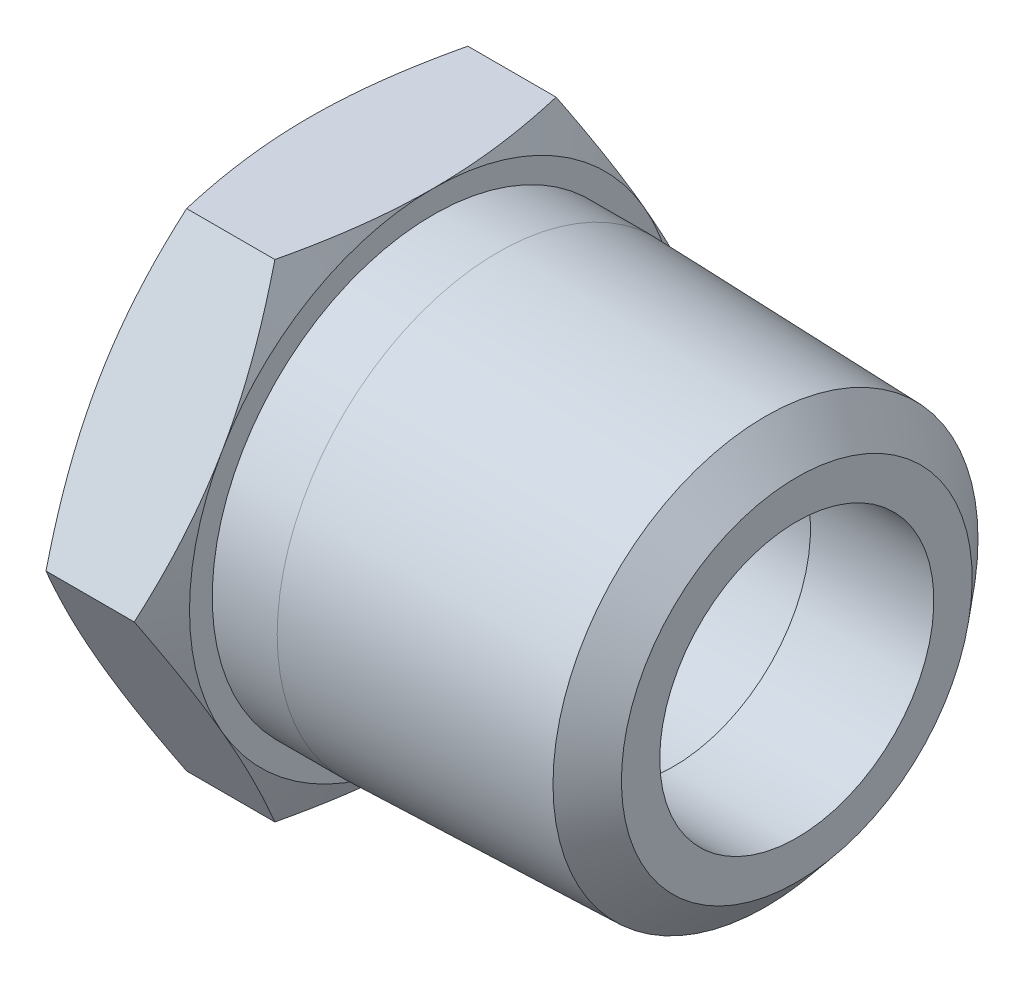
ISO-10303-21;
HEADER;
FILE_DESCRIPTION(('STEP AP214'),'2;1');
FILE_NAME('part.step','',(''),(''),'','','');
FILE_SCHEMA(('AUTOMOTIVE_DESIGN { 1 0 10303 214 1 1 1 1 }'));
ENDSEC;
DATA;
#1=APPLICATION_CONTEXT('core data for automotive mechanical design processes');
#2=APPLICATION_PROTOCOL_DEFINITION('international standard','automotive_design',2000,#1);
#3=PRODUCT_CONTEXT('',#1,'mechanical');
#4=PRODUCT('Part','Part','',(#3));
#5=PRODUCT_RELATED_PRODUCT_CATEGORY('part','',(#4));
#6=PRODUCT_DEFINITION_FORMATION('','',#4);
#7=PRODUCT_DEFINITION_CONTEXT('part definition',#1,'design');
#8=PRODUCT_DEFINITION('design','',#6,#7);
#9=PRODUCT_DEFINITION_SHAPE('','',#8);
#10=(LENGTH_UNIT() NAMED_UNIT(*) SI_UNIT(.MILLI.,.METRE.));
#11=(NAMED_UNIT(*) PLANE_ANGLE_UNIT() SI_UNIT($,.RADIAN.));
#12=(NAMED_UNIT(*) SI_UNIT($,.STERADIAN.) SOLID_ANGLE_UNIT());
#13=UNCERTAINTY_MEASURE_WITH_UNIT(LENGTH_MEASURE(1.E-05),#10,'distance_accuracy_value','');
#14=(GEOMETRIC_REPRESENTATION_CONTEXT(3) GLOBAL_UNCERTAINTY_ASSIGNED_CONTEXT((#13)) GLOBAL_UNIT_ASSIGNED_CONTEXT((#10,
#11,#12)) REPRESENTATION_CONTEXT('',''));
#15=CARTESIAN_POINT('',(0.,0.,0.));
#16=DIRECTION('',(0.,0.,1.));
#17=DIRECTION('',(1.,0.,0.));
#18=AXIS2_PLACEMENT_3D('',#15,#16,#17);
#19=CARTESIAN_POINT('',(-6.25277607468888E-10,0.,0.));
#20=DIRECTION('',(-1.,0.,0.));
#21=DIRECTION('',(0.,0.,1.));
#22=AXIS2_PLACEMENT_3D('',#19,#20,#21);
#23=CONICAL_SURFACE('',#22,7.11199999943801,0.816517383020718);
#24=CARTESIAN_POINT('',(1.17665145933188,0.,0.));
#25=DIRECTION('',(-1.,0.,0.));
#26=DIRECTION('',(0.,1.,0.));
#27=AXIS2_PLACEMENT_3D('',#24,#25,#26);
#28=CIRCLE('',#27,5.85973824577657);
#29=CARTESIAN_POINT('',(1.17665145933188,5.85973824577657,0.));
#30=VERTEX_POINT('',#29);
#31=EDGE_CURVE('E380',#30,#30,#28,.F.);
#32=ORIENTED_EDGE('',*,*,#31,.T.);
#33=EDGE_LOOP('',(#32));
#34=FACE_BOUND('',#33,.T.);
#35=CARTESIAN_POINT('',(-6.25277607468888E-10,0.,0.));
#36=DIRECTION('',(-1.,0.,0.));
#37=DIRECTION('',(0.,0.,1.));
#38=AXIS2_PLACEMENT_3D('',#35,#36,#37);
#39=CIRCLE('',#38,7.11199999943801);
#40=CARTESIAN_POINT('',(-6.25277607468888E-10,0.,7.11199999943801));
#41=VERTEX_POINT('',#40);
#42=EDGE_CURVE('E20',#41,#41,#39,.T.);
#43=ORIENTED_EDGE('',*,*,#42,.T.);
#44=EDGE_LOOP('',(#43));
#45=FACE_BOUND('',#44,.T.);
#46=ADVANCED_FACE('F16',(#34,#45),#23,.F.);
#47=CARTESIAN_POINT('',(1.17665145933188,0.,0.));
#48=DIRECTION('',(-1.,0.,0.));
#49=DIRECTION('',(0.,0.,1.));
#50=AXIS2_PLACEMENT_3D('',#47,#48,#49);
#51=CONICAL_SURFACE('',#50,5.85973824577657,0.0311192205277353);
#52=CARTESIAN_POINT('',(9.906,0.,0.));
#53=DIRECTION('',(1.,0.,0.));
#54=DIRECTION('',(0.,0.,-1.));
#55=AXIS2_PLACEMENT_3D('',#52,#53,#54);
#56=CIRCLE('',#55,5.588);
#57=CARTESIAN_POINT('',(9.906,0.,-5.588));
#58=VERTEX_POINT('',#57);
#59=EDGE_CURVE('E114',#58,#58,#56,.T.);
#60=ORIENTED_EDGE('',*,*,#59,.T.);
#61=EDGE_LOOP('',(#60));
#62=FACE_BOUND('',#61,.T.);
#63=ORIENTED_EDGE('',*,*,#31,.F.);
#64=EDGE_LOOP('',(#63));
#65=FACE_BOUND('',#64,.T.);
#66=ADVANCED_FACE('F616',(#62,#65),#51,.F.);
#67=CARTESIAN_POINT('',(0.,0.,0.));
#68=DIRECTION('',(1.,0.,0.));
#69=DIRECTION('',(0.,0.,-1.));
#70=AXIS2_PLACEMENT_3D('',#67,#68,#69);
#71=PLANE('',#70);
#72=ORIENTED_EDGE('',*,*,#42,.F.);
#73=EDGE_LOOP('',(#72));
#74=FACE_BOUND('',#73,.T.);
#75=CARTESIAN_POINT('',(-6.1736963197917E-09,0.,0.));
#76=DIRECTION('',(1.,0.,0.));
#77=DIRECTION('',(0.,0.,-1.));
#78=AXIS2_PLACEMENT_3D('',#75,#76,#77);
#79=CIRCLE('',#78,9.52500000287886);
#80=CARTESIAN_POINT('',(-6.84491351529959E-09,-4.76250000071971,-8.24889197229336));
#81=VERTEX_POINT('',#80);
#82=CARTESIAN_POINT('',(-6.84491939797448E-09,4.76250000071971,-8.24889197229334));
#83=VERTEX_POINT('',#82);
#84=EDGE_CURVE('E106',#81,#83,#79,.T.);
#85=ORIENTED_EDGE('',*,*,#84,.F.);
#86=CARTESIAN_POINT('',(-6.17370076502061E-09,0.,0.));
#87=DIRECTION('',(1.,0.,0.));
#88=DIRECTION('',(0.,0.,-1.));
#89=AXIS2_PLACEMENT_3D('',#86,#87,#88);
#90=CIRCLE('',#89,9.52500000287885);
#91=CARTESIAN_POINT('',(-6.84491439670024E-09,-9.52500000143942,0.));
#92=VERTEX_POINT('',#91);
#93=EDGE_CURVE('E125',#92,#81,#90,.T.);
#94=ORIENTED_EDGE('',*,*,#93,.F.);
#95=CARTESIAN_POINT('',(-6.17370466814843E-09,0.,0.));
#96=DIRECTION('',(1.,0.,0.));
#97=DIRECTION('',(0.,0.,-1.));
#98=AXIS2_PLACEMENT_3D('',#95,#96,#97);
#99=CIRCLE('',#98,9.52500000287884);
#100=CARTESIAN_POINT('',(-6.84491424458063E-09,-4.76250000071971,8.24889197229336));
#101=VERTEX_POINT('',#100);
#102=EDGE_CURVE('E445',#101,#92,#99,.T.);
#103=ORIENTED_EDGE('',*,*,#102,.F.);
#104=CARTESIAN_POINT('',(-6.1736963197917E-09,0.,0.));
#105=DIRECTION('',(1.,0.,0.));
#106=DIRECTION('',(0.,0.,-1.));
#107=AXIS2_PLACEMENT_3D('',#104,#105,#106);
#108=CIRCLE('',#107,9.52500000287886);
#109=CARTESIAN_POINT('',(-6.84491379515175E-09,4.76250000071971,8.24889197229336));
#110=VERTEX_POINT('',#109);
#111=EDGE_CURVE('E447',#110,#101,#108,.T.);
#112=ORIENTED_EDGE('',*,*,#111,.F.);
#113=CARTESIAN_POINT('',(-6.17370076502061E-09,0.,0.));
#114=DIRECTION('',(1.,0.,0.));
#115=DIRECTION('',(0.,0.,-1.));
#116=AXIS2_PLACEMENT_3D('',#113,#114,#115);
#117=CIRCLE('',#116,9.52500000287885);
#118=CARTESIAN_POINT('',(-6.84491440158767E-09,9.52500000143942,0.));
#119=VERTEX_POINT('',#118);
#120=EDGE_CURVE('E109',#119,#110,#117,.T.);
#121=ORIENTED_EDGE('',*,*,#120,.F.);
#122=CARTESIAN_POINT('',(-6.1737051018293E-09,0.,0.));
#123=DIRECTION('',(1.,0.,0.));
#124=DIRECTION('',(0.,0.,-1.));
#125=AXIS2_PLACEMENT_3D('',#122,#123,#124);
#126=CIRCLE('',#125,9.52500000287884);
#127=EDGE_CURVE('E103',#83,#119,#126,.T.);
#128=ORIENTED_EDGE('',*,*,#127,.F.);
#129=EDGE_LOOP('',(#85,#94,#103,#112,#121,#128));
#130=FACE_BOUND('',#129,.T.);
#131=ADVANCED_FACE('F105',(#74,#130),#71,.F.);
#132=CARTESIAN_POINT('',(9.906,0.,0.));
#133=DIRECTION('',(1.,0.,0.));
#134=DIRECTION('',(0.,0.,-1.));
#135=AXIS2_PLACEMENT_3D('',#132,#133,#134);
#136=CYLINDRICAL_SURFACE('',#135,5.588);
#137=ORIENTED_EDGE('',*,*,#59,.F.);
#138=EDGE_LOOP('',(#137));
#139=FACE_BOUND('',#138,.T.);
#140=CARTESIAN_POINT('',(14.224,0.,0.));
#141=DIRECTION('',(1.,0.,0.));
#142=DIRECTION('',(0.,0.,-1.));
#143=AXIS2_PLACEMENT_3D('',#140,#141,#142);
#144=CIRCLE('',#143,5.588);
#145=CARTESIAN_POINT('',(14.224,0.,-5.588));
#146=VERTEX_POINT('',#145);
#147=EDGE_CURVE('E124',#146,#146,#144,.T.);
#148=ORIENTED_EDGE('',*,*,#147,.T.);
#149=EDGE_LOOP('',(#148));
#150=FACE_BOUND('',#149,.T.);
#151=ADVANCED_FACE('F604',(#139,#150),#136,.F.);
#152=CARTESIAN_POINT('',(0.691237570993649,0.,0.));
#153=DIRECTION('',(1.,0.,0.));
#154=DIRECTION('',(0.,0.,-1.));
#155=AXIS2_PLACEMENT_3D('',#152,#153,#154);
#156=CONICAL_SURFACE('',#155,11.0073637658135,1.1344640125);
#157=ORIENTED_EDGE('',*,*,#127,.T.);
#158=CARTESIAN_POINT('',(0.687114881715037,9.52499999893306,-5.49926131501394));
#159=CARTESIAN_POINT('',(0.581879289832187,9.52499999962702,-5.04806884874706));
#160=CARTESIAN_POINT('',(0.485840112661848,9.52499999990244,-4.59444540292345));
#161=CARTESIAN_POINT('',(0.316783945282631,9.52500000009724,-3.68454136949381));
#162=CARTESIAN_POINT('',(0.243690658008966,9.52500000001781,-3.22827483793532));
#163=CARTESIAN_POINT('',(0.154189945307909,9.52499999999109,-2.54105947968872));
#164=CARTESIAN_POINT('',(0.127705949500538,9.5249999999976,-2.3114203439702));
#165=CARTESIAN_POINT('',(0.0819146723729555,9.5250000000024,-1.85142525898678));
#166=CARTESIAN_POINT('',(0.0626072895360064,9.52500000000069,-1.62106931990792));
#167=CARTESIAN_POINT('',(0.031492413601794,9.52499999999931,-1.15907579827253));
#168=CARTESIAN_POINT('',(0.0197101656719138,9.52499999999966,-0.927436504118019));
#169=CARTESIAN_POINT('',(0.00394974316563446,9.52500000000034,-0.463867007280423));
#170=CARTESIAN_POINT('',(-2.75341416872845E-05,9.52500000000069,-0.231936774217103));
#171=CARTESIAN_POINT('',(-7.5161284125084E-09,9.525,-1.4605006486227E-10));
#172=B_SPLINE_CURVE_WITH_KNOTS('',3,(#158,#159,#160,#161,#162,#163,#164,#165,#166,#167,#168,
#169,#170,#171),.UNSPECIFIED.,.F.,.F.,(4,2,2,2,2,2,4),(0.,1.39025784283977,2.77584275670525,
3.46922419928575,4.16259583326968,4.858281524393,5.55404718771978),.UNSPECIFIED.);
#173=CARTESIAN_POINT('',(0.687114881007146,9.52500000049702,-5.49926131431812));
#174=VERTEX_POINT('',#173);
#175=EDGE_CURVE('E130',#174,#119,#172,.T.);
#176=ORIENTED_EDGE('',*,*,#175,.F.);
#177=CARTESIAN_POINT('',(-6.88972180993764E-09,4.76249999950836,-8.24889197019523));
#178=CARTESIAN_POINT('',(-2.75339178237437E-05,4.9633631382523,-8.1329235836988));
#179=CARTESIAN_POINT('',(0.00394974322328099,5.16422061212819,-8.01695846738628));
#180=CARTESIAN_POINT('',(0.0197101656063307,5.56568357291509,-7.78517371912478));
#181=CARTESIAN_POINT('',(0.0314924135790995,5.76628908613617,-7.66935407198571));
#182=CARTESIAN_POINT('',(0.06260728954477,6.16638721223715,-7.43835731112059));
#183=CARTESIAN_POINT('',(0.08191467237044,6.36588130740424,-7.32317934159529));
#184=CARTESIAN_POINT('',(0.127705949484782,6.76424873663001,-7.09318179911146));
#185=CARTESIAN_POINT('',(0.154189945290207,6.96312206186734,-6.97836223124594));
#186=CARTESIAN_POINT('',(0.243690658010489,7.55826801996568,-6.634754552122));
#187=CARTESIAN_POINT('',(0.316783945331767,7.95340642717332,-6.40662128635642));
#188=CARTESIAN_POINT('',(0.48584011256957,8.74140643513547,-5.95166926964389));
#189=CARTESIAN_POINT('',(0.581879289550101,9.13425586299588,-5.72485754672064));
#190=CARTESIAN_POINT('',(0.687114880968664,9.52500000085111,-5.49926131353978));
#191=B_SPLINE_CURVE_WITH_KNOTS('',3,(#177,#178,#179,#180,#181,#182,#183,#184,#185,#186,#187,
#188,#189,#190),.UNSPECIFIED.,.F.,.F.,(4,2,2,2,2,2,4),(0.,0.695765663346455,1.39145135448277,
2.08482298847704,2.77820443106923,4.16378934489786,5.55404718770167),.UNSPECIFIED.);
#192=EDGE_CURVE('E127',#83,#174,#191,.T.);
#193=ORIENTED_EDGE('',*,*,#192,.F.);
#194=EDGE_LOOP('',(#157,#176,#193));
#195=FACE_BOUND('',#194,.T.);
#196=ADVANCED_FACE('F128',(#195),#156,.T.);
#197=CARTESIAN_POINT('',(0.691237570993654,0.,0.));
#198=DIRECTION('',(1.,0.,0.));
#199=DIRECTION('',(0.,0.,-1.));
#200=AXIS2_PLACEMENT_3D('',#197,#198,#199);
#201=CONICAL_SURFACE('',#200,11.0073637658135,1.1344640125);
#202=CARTESIAN_POINT('',(-6.88971572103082E-09,9.52499999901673,0.));
#203=CARTESIAN_POINT('',(-2.75339178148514E-05,9.5249999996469,0.231936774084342));
#204=CARTESIAN_POINT('',(0.00394974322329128,9.52499999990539,0.463867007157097));
#205=CARTESIAN_POINT('',(0.0197101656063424,9.5250000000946,0.927436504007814));
#206=CARTESIAN_POINT('',(0.0314924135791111,9.52500000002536,1.15907579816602));
#207=CARTESIAN_POINT('',(0.0626072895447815,9.52499999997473,1.62106931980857));
#208=CARTESIAN_POINT('',(0.0819146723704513,9.52499999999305,1.85142525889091));
#209=CARTESIAN_POINT('',(0.127705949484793,9.52500000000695,2.31142034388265));
#210=CARTESIAN_POINT('',(0.154189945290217,9.52500000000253,2.54105947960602));
#211=CARTESIAN_POINT('',(0.243690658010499,9.52499999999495,3.22827483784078));
#212=CARTESIAN_POINT('',(0.316783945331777,9.52499999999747,3.6845413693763));
#213=CARTESIAN_POINT('',(0.485840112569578,9.52500000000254,4.59444540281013));
#214=CARTESIAN_POINT('',(0.581879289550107,9.52500000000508,5.04806884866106));
#215=CARTESIAN_POINT('',(0.687114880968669,9.525,5.49926131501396));
#216=B_SPLINE_CURVE_WITH_KNOTS('',3,(#202,#203,#204,#205,#206,#207,#208,#209,#210,#211,#212,
#213,#214,#215),.UNSPECIFIED.,.F.,.F.,(4,2,2,2,2,2,4),(0.,0.695765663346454,1.39145135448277,
2.08482298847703,2.77820443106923,4.16378934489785,5.55404718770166),.UNSPECIFIED.);
#217=CARTESIAN_POINT('',(0.687114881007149,9.52500000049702,5.49926131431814));
#218=VERTEX_POINT('',#217);
#219=EDGE_CURVE('E299',#119,#218,#216,.T.);
#220=ORIENTED_EDGE('',*,*,#219,.F.);
#221=ORIENTED_EDGE('',*,*,#120,.T.);
#222=CARTESIAN_POINT('',(0.687114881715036,9.52500000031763,5.4992613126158));
#223=CARTESIAN_POINT('',(0.58187928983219,9.13425586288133,5.72485754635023));
#224=CARTESIAN_POINT('',(0.485840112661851,8.74140643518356,5.95166926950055));
#225=CARTESIAN_POINT('',(0.316783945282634,7.95340642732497,6.40662128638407));
#226=CARTESIAN_POINT('',(0.243690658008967,7.55826802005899,6.63475455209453));
#227=CARTESIAN_POINT('',(0.15418994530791,6.96312206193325,6.97836223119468));
#228=CARTESIAN_POINT('',(0.127705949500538,6.76424873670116,7.09318179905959));
#229=CARTESIAN_POINT('',(0.0819146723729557,6.36588130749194,7.32317934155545));
#230=CARTESIAN_POINT('',(0.0626072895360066,6.16638721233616,7.4383573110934));
#231=CARTESIAN_POINT('',(0.0314924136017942,5.76628908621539,7.6693540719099));
#232=CARTESIAN_POINT('',(0.0197101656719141,5.56568357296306,7.78517371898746));
#233=CARTESIAN_POINT('',(0.00394974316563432,5.16422061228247,8.01695846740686));
#234=CARTESIAN_POINT('',(-2.7534141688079E-05,4.96336313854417,8.13292358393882));
#235=CARTESIAN_POINT('',(-7.51613087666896E-09,4.76250000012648,8.24889197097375));
#236=B_SPLINE_CURVE_WITH_KNOTS('',3,(#222,#223,#224,#225,#226,#227,#228,#229,#230,#231,#232,
#233,#234,#235),.UNSPECIFIED.,.F.,.F.,(4,2,2,2,2,2,4),(0.,1.39025784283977,2.77584275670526,
3.46922419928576,4.1625958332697,4.85828152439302,5.5540471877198),.UNSPECIFIED.);
#237=EDGE_CURVE('E292',#218,#110,#236,.T.);
#238=ORIENTED_EDGE('',*,*,#237,.F.);
#239=EDGE_LOOP('',(#220,#221,#238));
#240=FACE_BOUND('',#239,.T.);
#241=ADVANCED_FACE('F282',(#240),#201,.T.);
#242=CARTESIAN_POINT('',(0.69123757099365,0.,0.));
#243=DIRECTION('',(1.,0.,0.));
#244=DIRECTION('',(0.,0.,-1.));
#245=AXIS2_PLACEMENT_3D('',#242,#243,#244);
#246=CONICAL_SURFACE('',#245,11.0073637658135,1.1344640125);
#247=CARTESIAN_POINT('',(-6.88972179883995E-09,4.76249999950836,8.24889197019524));
#248=CARTESIAN_POINT('',(-2.75339178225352E-05,4.56163686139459,8.36486035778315));
#249=CARTESIAN_POINT('',(0.00394974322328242,4.36077938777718,8.48082547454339));
#250=CARTESIAN_POINT('',(0.0197101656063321,3.9593164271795,8.7126102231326));
#251=CARTESIAN_POINT('',(0.0314924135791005,3.75871091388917,8.82842987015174));
#252=CARTESIAN_POINT('',(0.0626072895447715,3.35861278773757,9.05942663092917));
#253=CARTESIAN_POINT('',(0.0819146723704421,3.1591186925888,9.17460460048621));
#254=CARTESIAN_POINT('',(0.127705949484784,2.76075126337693,9.40460214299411));
#255=CARTESIAN_POINT('',(0.154189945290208,2.56187793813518,9.51942171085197));
#256=CARTESIAN_POINT('',(0.24369065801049,1.96673198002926,9.86302938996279));
#257=CARTESIAN_POINT('',(0.316783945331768,1.57159357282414,10.0911626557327));
#258=CARTESIAN_POINT('',(0.485840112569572,0.783593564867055,10.546114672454));
#259=CARTESIAN_POINT('',(0.581879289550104,0.390744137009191,10.7729263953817));
#260=CARTESIAN_POINT('',(0.687114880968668,-8.51118452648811E-10,10.9985226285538));
#261=B_SPLINE_CURVE_WITH_KNOTS('',3,(#247,#248,#249,#250,#251,#252,#253,#254,#255,#256,#257,
#258,#259,#260),.UNSPECIFIED.,.F.,.F.,(4,2,2,2,2,2,4),(0.,0.695765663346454,1.39145135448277,
2.08482298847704,2.77820443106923,4.16378934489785,5.55404718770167),.UNSPECIFIED.);
#262=CARTESIAN_POINT('',(0.687114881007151,0.,10.9985226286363));
#263=VERTEX_POINT('',#262);
#264=EDGE_CURVE('E286',#110,#263,#261,.T.);
#265=ORIENTED_EDGE('',*,*,#264,.F.);
#266=ORIENTED_EDGE('',*,*,#111,.T.);
#267=CARTESIAN_POINT('',(0.687114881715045,1.38456617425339E-09,10.9985226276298));
#268=CARTESIAN_POINT('',(0.581879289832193,-0.390744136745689,10.7729263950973));
#269=CARTESIAN_POINT('',(0.485840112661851,-0.783593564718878,10.546114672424));
#270=CARTESIAN_POINT('',(0.316783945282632,-1.57159357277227,10.0911626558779));
#271=CARTESIAN_POINT('',(0.243690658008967,-1.96673197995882,9.86302939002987));
#272=CARTESIAN_POINT('',(0.154189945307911,-2.56187793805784,9.51942171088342));
#273=CARTESIAN_POINT('',(0.12770594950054,-2.76075126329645,9.4046021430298));
#274=CARTESIAN_POINT('',(0.0819146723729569,-3.15911869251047,9.17460460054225));
#275=CARTESIAN_POINT('',(0.0626072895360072,-3.35861278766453,9.05942663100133));
#276=CARTESIAN_POINT('',(0.0314924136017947,-3.75871091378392,8.82842987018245));
#277=CARTESIAN_POINT('',(0.0197101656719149,-3.9593164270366,8.71261022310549));
#278=CARTESIAN_POINT('',(0.00394974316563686,-4.36077938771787,8.48082547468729));
#279=CARTESIAN_POINT('',(-2.75341416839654E-05,-4.56163686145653,8.36486035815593));
#280=CARTESIAN_POINT('',(-7.51612411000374E-09,-4.76249999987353,8.24889197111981));
#281=B_SPLINE_CURVE_WITH_KNOTS('',3,(#267,#268,#269,#270,#271,#272,#273,#274,#275,#276,#277,
#278,#279,#280),.UNSPECIFIED.,.F.,.F.,(4,2,2,2,2,2,4),(0.,1.39025784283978,2.77584275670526,
3.46922419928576,4.1625958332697,4.85828152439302,5.5540471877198),.UNSPECIFIED.);
#282=EDGE_CURVE('E263',#263,#101,#281,.T.);
#283=ORIENTED_EDGE('',*,*,#282,.F.);
#284=EDGE_LOOP('',(#265,#266,#283));
#285=FACE_BOUND('',#284,.T.);
#286=ADVANCED_FACE('F276',(#285),#246,.T.);
#287=CARTESIAN_POINT('',(0.691237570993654,0.,0.));
#288=DIRECTION('',(1.,0.,0.));
#289=DIRECTION('',(0.,0.,-1.));
#290=AXIS2_PLACEMENT_3D('',#287,#288,#289);
#291=CONICAL_SURFACE('',#290,11.0073637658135,1.1344640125);
#292=CARTESIAN_POINT('',(-6.88970853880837E-09,-4.76249999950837,8.24889197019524));
#293=CARTESIAN_POINT('',(-2.75339178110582E-05,-4.96336313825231,8.13292358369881));
#294=CARTESIAN_POINT('',(0.00394974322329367,-5.1642206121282,8.0169584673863));
#295=CARTESIAN_POINT('',(0.0197101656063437,-5.5656835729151,7.7851737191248));
#296=CARTESIAN_POINT('',(0.0314924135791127,-5.76628908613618,7.66935407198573));
#297=CARTESIAN_POINT('',(0.0626072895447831,-6.16638721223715,7.43835731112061));
#298=CARTESIAN_POINT('',(0.0819146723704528,-6.36588130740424,7.3231793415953));
#299=CARTESIAN_POINT('',(0.127705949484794,-6.76424873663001,7.09318179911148));
#300=CARTESIAN_POINT('',(0.154189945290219,-6.96312206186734,6.97836223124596));
#301=CARTESIAN_POINT('',(0.2436906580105,-7.55826801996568,6.63475455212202));
#302=CARTESIAN_POINT('',(0.316783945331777,-7.95340642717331,6.40662128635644));
#303=CARTESIAN_POINT('',(0.485840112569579,-8.74140643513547,5.95166926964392));
#304=CARTESIAN_POINT('',(0.581879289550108,-9.13425586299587,5.72485754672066));
#305=CARTESIAN_POINT('',(0.687114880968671,-9.5250000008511,5.49926131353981));
#306=B_SPLINE_CURVE_WITH_KNOTS('',3,(#292,#293,#294,#295,#296,#297,#298,#299,#300,#301,#302,
#303,#304,#305),.UNSPECIFIED.,.F.,.F.,(4,2,2,2,2,2,4),(0.,0.695765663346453,1.39145135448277,
2.08482298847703,2.77820443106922,4.16378934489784,5.55404718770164),.UNSPECIFIED.);
#307=CARTESIAN_POINT('',(0.687114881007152,-9.52500000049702,5.49926131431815));
#308=VERTEX_POINT('',#307);
#309=EDGE_CURVE('E257',#101,#308,#306,.T.);
#310=ORIENTED_EDGE('',*,*,#309,.F.);
#311=ORIENTED_EDGE('',*,*,#102,.T.);
#312=CARTESIAN_POINT('',(0.687114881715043,-9.52499999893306,5.49926131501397));
#313=CARTESIAN_POINT('',(0.581879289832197,-9.52499999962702,5.04806884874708));
#314=CARTESIAN_POINT('',(0.485840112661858,-9.52499999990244,4.59444540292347));
#315=CARTESIAN_POINT('',(0.31678394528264,-9.52500000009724,3.68454136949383));
#316=CARTESIAN_POINT('',(0.243690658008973,-9.52500000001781,3.22827483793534));
#317=CARTESIAN_POINT('',(0.154189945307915,-9.52499999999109,2.54105947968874));
#318=CARTESIAN_POINT('',(0.127705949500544,-9.5249999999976,2.31142034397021));
#319=CARTESIAN_POINT('',(0.0819146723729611,-9.5250000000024,1.85142525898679));
#320=CARTESIAN_POINT('',(0.0626072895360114,-9.52500000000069,1.62106931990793));
#321=CARTESIAN_POINT('',(0.0314924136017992,-9.52499999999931,1.15907579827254));
#322=CARTESIAN_POINT('',(0.0197101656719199,-9.52499999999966,0.927436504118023));
#323=CARTESIAN_POINT('',(0.00394974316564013,-9.52500000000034,0.463867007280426));
#324=CARTESIAN_POINT('',(-2.75341416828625E-05,-9.52500000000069,0.231936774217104));
#325=CARTESIAN_POINT('',(-7.51612806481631E-09,-9.525,1.46051092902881E-10));
#326=B_SPLINE_CURVE_WITH_KNOTS('',3,(#312,#313,#314,#315,#316,#317,#318,#319,#320,#321,#322,
#323,#324,#325),.UNSPECIFIED.,.F.,.F.,(4,2,2,2,2,2,4),(0.,1.39025784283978,2.77584275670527,
3.46922419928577,4.16259583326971,4.85828152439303,5.55404718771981),.UNSPECIFIED.);
#327=EDGE_CURVE('E264',#308,#92,#326,.T.);
#328=ORIENTED_EDGE('',*,*,#327,.F.);
#329=EDGE_LOOP('',(#310,#311,#328));
#330=FACE_BOUND('',#329,.T.);
#331=ADVANCED_FACE('F273',(#330),#291,.T.);
#332=CARTESIAN_POINT('',(0.691237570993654,0.,0.));
#333=DIRECTION('',(1.,0.,0.));
#334=DIRECTION('',(0.,0.,-1.));
#335=AXIS2_PLACEMENT_3D('',#332,#333,#334);
#336=CONICAL_SURFACE('',#335,11.0073637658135,1.1344640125);
#337=ORIENTED_EDGE('',*,*,#93,.T.);
#338=CARTESIAN_POINT('',(0.687114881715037,-9.52500000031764,-5.4992613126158));
#339=CARTESIAN_POINT('',(0.581879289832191,-9.13425586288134,-5.72485754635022));
#340=CARTESIAN_POINT('',(0.485840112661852,-8.74140643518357,-5.95166926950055));
#341=CARTESIAN_POINT('',(0.316783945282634,-7.95340642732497,-6.40662128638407));
#342=CARTESIAN_POINT('',(0.243690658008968,-7.558268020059,-6.63475455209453));
#343=CARTESIAN_POINT('',(0.154189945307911,-6.96312206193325,-6.97836223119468));
#344=CARTESIAN_POINT('',(0.127705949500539,-6.76424873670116,-7.09318179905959));
#345=CARTESIAN_POINT('',(0.0819146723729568,-6.36588130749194,-7.32317934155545));
#346=CARTESIAN_POINT('',(0.0626072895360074,-6.16638721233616,-7.4383573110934));
#347=CARTESIAN_POINT('',(0.0314924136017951,-5.76628908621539,-7.66935407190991));
#348=CARTESIAN_POINT('',(0.0197101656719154,-5.56568357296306,-7.78517371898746));
#349=CARTESIAN_POINT('',(0.00394974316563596,-5.16422061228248,-8.01695846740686));
#350=CARTESIAN_POINT('',(-2.75341416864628E-05,-4.96336313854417,-8.13292358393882));
#351=CARTESIAN_POINT('',(-7.51613003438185E-09,-4.76250000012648,-8.24889197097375));
#352=B_SPLINE_CURVE_WITH_KNOTS('',3,(#338,#339,#340,#341,#342,#343,#344,#345,#346,#347,#348,
#349,#350,#351),.UNSPECIFIED.,.F.,.F.,(4,2,2,2,2,2,4),(0.,1.39025784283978,2.77584275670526,
3.46922419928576,4.1625958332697,4.85828152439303,5.55404718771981),.UNSPECIFIED.);
#353=CARTESIAN_POINT('',(0.687114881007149,-9.52500000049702,-5.49926131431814));
#354=VERTEX_POINT('',#353);
#355=EDGE_CURVE('E168',#354,#81,#352,.T.);
#356=ORIENTED_EDGE('',*,*,#355,.F.);
#357=CARTESIAN_POINT('',(-6.88971571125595E-09,-9.52499999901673,0.));
#358=CARTESIAN_POINT('',(-2.75339178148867E-05,-9.5249999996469,-0.231936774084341));
#359=CARTESIAN_POINT('',(0.00394974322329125,-9.52499999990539,-0.463867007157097));
#360=CARTESIAN_POINT('',(0.0197101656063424,-9.5250000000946,-0.927436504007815));
#361=CARTESIAN_POINT('',(0.0314924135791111,-9.52500000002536,-1.15907579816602));
#362=CARTESIAN_POINT('',(0.0626072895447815,-9.52499999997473,-1.62106931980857));
#363=CARTESIAN_POINT('',(0.0819146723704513,-9.52499999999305,-1.85142525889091));
#364=CARTESIAN_POINT('',(0.127705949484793,-9.52500000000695,-2.31142034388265));
#365=CARTESIAN_POINT('',(0.154189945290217,-9.52500000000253,-2.54105947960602));
#366=CARTESIAN_POINT('',(0.243690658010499,-9.52499999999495,-3.22827483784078));
#367=CARTESIAN_POINT('',(0.316783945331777,-9.52499999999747,-3.6845413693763));
#368=CARTESIAN_POINT('',(0.485840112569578,-9.52500000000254,-4.59444540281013));
#369=CARTESIAN_POINT('',(0.581879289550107,-9.52500000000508,-5.04806884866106));
#370=CARTESIAN_POINT('',(0.687114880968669,-9.525,-5.49926131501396));
#371=B_SPLINE_CURVE_WITH_KNOTS('',3,(#357,#358,#359,#360,#361,#362,#363,#364,#365,#366,#367,
#368,#369,#370),.UNSPECIFIED.,.F.,.F.,(4,2,2,2,2,2,4),(0.,0.695765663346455,1.39145135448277,
2.08482298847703,2.77820443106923,4.16378934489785,5.55404718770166),.UNSPECIFIED.);
#372=EDGE_CURVE('E370',#92,#354,#371,.T.);
#373=ORIENTED_EDGE('',*,*,#372,.F.);
#374=EDGE_LOOP('',(#337,#356,#373));
#375=FACE_BOUND('',#374,.T.);
#376=ADVANCED_FACE('F157',(#375),#336,.T.);
#377=CARTESIAN_POINT('',(0.69123757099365,0.,0.));
#378=DIRECTION('',(1.,0.,0.));
#379=DIRECTION('',(0.,0.,-1.));
#380=AXIS2_PLACEMENT_3D('',#377,#378,#379);
#381=CONICAL_SURFACE('',#380,11.0073637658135,1.1344640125);
#382=ORIENTED_EDGE('',*,*,#84,.T.);
#383=CARTESIAN_POINT('',(0.687114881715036,-1.38457935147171E-09,-10.9985226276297));
#384=CARTESIAN_POINT('',(0.581879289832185,0.390744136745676,-10.7729263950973));
#385=CARTESIAN_POINT('',(0.485840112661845,0.783593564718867,-10.546114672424));
#386=CARTESIAN_POINT('',(0.316783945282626,1.57159357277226,-10.0911626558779));
#387=CARTESIAN_POINT('',(0.243690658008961,1.96673197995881,-9.86302939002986));
#388=CARTESIAN_POINT('',(0.154189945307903,2.56187793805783,-9.51942171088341));
#389=CARTESIAN_POINT('',(0.127705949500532,2.76075126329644,-9.40460214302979));
#390=CARTESIAN_POINT('',(0.0819146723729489,3.15911869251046,-9.17460460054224));
#391=CARTESIAN_POINT('',(0.0626072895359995,3.35861278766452,-9.05942663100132));
#392=CARTESIAN_POINT('',(0.031492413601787,3.75871091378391,-8.82842987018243));
#393=CARTESIAN_POINT('',(0.0197101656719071,3.95931642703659,-8.71261022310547));
#394=CARTESIAN_POINT('',(0.00394974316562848,4.36077938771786,-8.48082547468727));
#395=CARTESIAN_POINT('',(-2.7534141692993E-05,4.56163686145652,-8.36486035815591));
#396=CARTESIAN_POINT('',(-7.5161343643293E-09,4.76249999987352,-8.24889197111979));
#397=B_SPLINE_CURVE_WITH_KNOTS('',3,(#383,#384,#385,#386,#387,#388,#389,#390,#391,#392,#393,
#394,#395,#396),.UNSPECIFIED.,.F.,.F.,(4,2,2,2,2,2,4),(0.,1.39025784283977,2.77584275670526,
3.46922419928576,4.1625958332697,4.85828152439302,5.5540471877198),.UNSPECIFIED.);
#398=CARTESIAN_POINT('',(0.687114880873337,-4.97021935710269E-10,-10.9985226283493));
#399=VERTEX_POINT('',#398);
#400=EDGE_CURVE('E119',#399,#83,#397,.T.);
#401=ORIENTED_EDGE('',*,*,#400,.F.);
#402=CARTESIAN_POINT('',(-6.88972115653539E-09,-4.76249999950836,-8.24889197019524));
#403=CARTESIAN_POINT('',(-2.75339178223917E-05,-4.56163686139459,-8.36486035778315));
#404=CARTESIAN_POINT('',(0.0039497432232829,-4.36077938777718,-8.48082547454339));
#405=CARTESIAN_POINT('',(0.0197101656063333,-3.9593164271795,-8.7126102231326));
#406=CARTESIAN_POINT('',(0.0314924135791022,-3.75871091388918,-8.82842987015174));
#407=CARTESIAN_POINT('',(0.0626072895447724,-3.35861278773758,-9.05942663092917));
#408=CARTESIAN_POINT('',(0.081914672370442,-3.15911869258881,-9.17460460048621));
#409=CARTESIAN_POINT('',(0.127705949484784,-2.76075126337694,-9.40460214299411));
#410=CARTESIAN_POINT('',(0.154189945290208,-2.56187793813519,-9.51942171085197));
#411=CARTESIAN_POINT('',(0.24369065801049,-1.96673198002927,-9.86302938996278));
#412=CARTESIAN_POINT('',(0.316783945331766,-1.57159357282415,-10.0911626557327));
#413=CARTESIAN_POINT('',(0.485840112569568,-0.78359356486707,-10.546114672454));
#414=CARTESIAN_POINT('',(0.581879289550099,-0.390744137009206,-10.7729263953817));
#415=CARTESIAN_POINT('',(0.687114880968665,8.5110547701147E-10,-10.9985226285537));
#416=B_SPLINE_CURVE_WITH_KNOTS('',3,(#402,#403,#404,#405,#406,#407,#408,#409,#410,#411,#412,
#413,#414,#415),.UNSPECIFIED.,.F.,.F.,(4,2,2,2,2,2,4),(0.,0.695765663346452,1.39145135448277,
2.08482298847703,2.77820443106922,4.16378934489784,5.55404718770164),.UNSPECIFIED.);
#417=EDGE_CURVE('E122',#81,#399,#416,.T.);
#418=ORIENTED_EDGE('',*,*,#417,.F.);
#419=EDGE_LOOP('',(#382,#401,#418));
#420=FACE_BOUND('',#419,.T.);
#421=ADVANCED_FACE('F117',(#420),#381,.T.);
#422=CARTESIAN_POINT('',(14.224,5.588,5.69976));
#423=DIRECTION('',(1.,0.,0.));
#424=DIRECTION('',(0.,-1.,0.));
#425=AXIS2_PLACEMENT_3D('',#422,#423,#424);
#426=PLANE('',#425);
#427=CARTESIAN_POINT('',(14.224,0.,0.));
#428=DIRECTION('',(-1.,0.,0.));
#429=DIRECTION('',(0.,0.,1.));
#430=AXIS2_PLACEMENT_3D('',#427,#428,#429);
#431=CIRCLE('',#430,5.3594);
#432=CARTESIAN_POINT('',(14.224,0.,5.3594));
#433=VERTEX_POINT('',#432);
#434=EDGE_CURVE('E169',#433,#433,#431,.F.);
#435=ORIENTED_EDGE('',*,*,#434,.T.);
#436=EDGE_LOOP('',(#435));
#437=FACE_BOUND('',#436,.T.);
#438=ORIENTED_EDGE('',*,*,#147,.F.);
#439=EDGE_LOOP('',(#438));
#440=FACE_BOUND('',#439,.T.);
#441=ADVANCED_FACE('F156',(#437,#440),#426,.F.);
#442=CARTESIAN_POINT('',(0.,9.525,-5.49926131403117));
#443=DIRECTION('',(0.,0.5,-0.866025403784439));
#444=DIRECTION('',(0.,0.866025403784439,0.5));
#445=AXIS2_PLACEMENT_3D('',#442,#443,#444);
#446=PLANE('',#445);
#447=ORIENTED_EDGE('',*,*,#192,.T.);
#448=DIRECTION('',(1.,0.,0.));
#449=VECTOR('',#448,1.);
#450=CARTESIAN_POINT('',(0.,9.525,-5.49926131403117));
#451=LINE('',#450,#449);
#452=CARTESIAN_POINT('',(4.13888512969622,9.525,-5.49926126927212));
#453=VERTEX_POINT('',#452);
#454=EDGE_CURVE('E133',#453,#174,#451,.F.);
#455=ORIENTED_EDGE('',*,*,#454,.F.);
#456=CARTESIAN_POINT('',(4.82600000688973,4.76249999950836,-8.24889197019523));
#457=CARTESIAN_POINT('',(4.82602753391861,4.96336313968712,-8.1329235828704));
#458=CARTESIAN_POINT('',(4.82205025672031,5.16422061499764,-8.0169584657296));
#459=CARTESIAN_POINT('',(4.8062898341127,5.56568357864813,-7.78517371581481));
#460=CARTESIAN_POINT('',(4.79450758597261,5.76628909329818,-7.66935406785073));
#461=CARTESIAN_POINT('',(4.76339270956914,6.16638722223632,-7.43835730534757));
#462=CARTESIAN_POINT('',(4.74408532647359,6.36588131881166,-7.32317933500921));
#463=CARTESIAN_POINT('',(4.69829404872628,6.76424875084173,-7.09318179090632));
#464=CARTESIAN_POINT('',(4.67181005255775,6.96312207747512,-6.97836222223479));
#465=CARTESIAN_POINT('',(4.58230933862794,7.55826803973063,-6.6347545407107));
#466=CARTESIAN_POINT('',(4.50921605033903,7.95340644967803,-6.40662127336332));
#467=CARTESIAN_POINT('',(4.34015988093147,8.74140646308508,-5.95166925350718));
#468=CARTESIAN_POINT('',(4.24412070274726,9.13425589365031,-5.72485752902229));
#469=CARTESIAN_POINT('',(4.13888511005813,9.52500003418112,-5.49926129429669));
#470=B_SPLINE_CURVE_WITH_KNOTS('',3,(#456,#457,#458,#459,#460,#461,#462,#463,#464,#465,#466,
#467,#468,#469),.UNSPECIFIED.,.F.,.F.,(4,2,2,2,2,2,4),(0.,0.695765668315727,1.39145136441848,
2.08482300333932,2.77820445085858,4.16378937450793,5.55404722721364),.UNSPECIFIED.);
#471=CARTESIAN_POINT('',(4.82600000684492,4.76250000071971,-8.24889197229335));
#472=VERTEX_POINT('',#471);
#473=EDGE_CURVE('E343',#472,#453,#470,.T.);
#474=ORIENTED_EDGE('',*,*,#473,.F.);
#475=CARTESIAN_POINT('',(4.13888513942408,7.71344093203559E-08,-10.9985225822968));
#476=CARTESIAN_POINT('',(4.24412072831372,0.39074420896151,-10.7729263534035));
#477=CARTESIAN_POINT('',(4.34015990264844,0.783593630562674,-10.5461146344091));
#478=CARTESIAN_POINT('',(4.50921606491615,1.57159362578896,-10.0911626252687));
#479=CARTESIAN_POINT('',(4.58230934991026,1.96673202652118,-9.86302936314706));
#480=CARTESIAN_POINT('',(4.67181005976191,2.56187797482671,-9.51942168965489));
#481=CARTESIAN_POINT('',(4.69829405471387,2.76075129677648,-9.40460212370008));
#482=CARTESIAN_POINT('',(4.74408533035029,3.15911871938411,-9.17460458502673));
#483=CARTESIAN_POINT('',(4.76339271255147,3.35861281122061,-9.0594266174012));
#484=CARTESIAN_POINT('',(4.79450758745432,3.75871093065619,-8.82842986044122));
#485=CARTESIAN_POINT('',(4.80628983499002,3.95931644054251,-8.71261021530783));
#486=CARTESIAN_POINT('',(4.82205025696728,4.36077939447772,-8.48082547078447));
#487=CARTESIAN_POINT('',(4.82602753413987,4.56163686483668,-8.36486035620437));
#488=CARTESIAN_POINT('',(4.82600000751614,4.76249999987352,-8.24889197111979));
#489=B_SPLINE_CURVE_WITH_KNOTS('',3,(#475,#476,#477,#478,#479,#480,#481,#482,#483,#484,#485,
#486,#487,#488),.UNSPECIFIED.,.F.,.F.,(4,2,2,2,2,2,4),(0.,1.39025781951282,2.77584271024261,
3.46922414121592,4.1625957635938,4.85828144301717,5.55404709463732),.UNSPECIFIED.);
#490=CARTESIAN_POINT('',(4.13888512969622,3.87624724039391E-08,-10.9985226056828));
#491=VERTEX_POINT('',#490);
#492=EDGE_CURVE('E354',#491,#472,#489,.T.);
#493=ORIENTED_EDGE('',*,*,#492,.F.);
#494=DIRECTION('',(1.,0.,0.));
#495=VECTOR('',#494,1.);
#496=CARTESIAN_POINT('',(0.,0.,-10.9985226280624));
#497=LINE('',#496,#495);
#498=EDGE_CURVE('E137',#399,#491,#497,.T.);
#499=ORIENTED_EDGE('',*,*,#498,.F.);
#500=ORIENTED_EDGE('',*,*,#400,.T.);
#501=EDGE_LOOP('',(#447,#455,#474,#493,#499,#500));
#502=FACE_BOUND('',#501,.T.);
#503=ADVANCED_FACE('F135',(#502),#446,.T.);
#504=CARTESIAN_POINT('',(0.,9.525,5.49926131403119));
#505=DIRECTION('',(0.,1.,0.));
#506=DIRECTION('',(0.,0.,1.));
#507=AXIS2_PLACEMENT_3D('',#504,#505,#506);
#508=PLANE('',#507);
#509=ORIENTED_EDGE('',*,*,#219,.T.);
#510=DIRECTION('',(1.,0.,0.));
#511=VECTOR('',#510,1.);
#512=CARTESIAN_POINT('',(0.,9.525,5.49926131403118));
#513=LINE('',#512,#511);
#514=CARTESIAN_POINT('',(4.13888512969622,9.52499996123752,5.49926133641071));
#515=VERTEX_POINT('',#514);
#516=EDGE_CURVE('E298',#515,#218,#513,.F.);
#517=ORIENTED_EDGE('',*,*,#516,.F.);
#518=CARTESIAN_POINT('',(4.82600000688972,9.52499999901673,0.));
#519=CARTESIAN_POINT('',(4.8260275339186,9.5249999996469,0.231936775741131));
#520=CARTESIAN_POINT('',(4.82205025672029,9.52499999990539,0.463867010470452));
#521=CARTESIAN_POINT('',(4.80628983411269,9.5250000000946,0.92743651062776));
#522=CARTESIAN_POINT('',(4.79450758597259,9.52500000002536,1.15907580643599));
#523=CARTESIAN_POINT('',(4.76339270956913,9.52499999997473,1.62106933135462));
#524=CARTESIAN_POINT('',(4.74408532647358,9.52499999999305,1.85142527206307));
#525=CARTESIAN_POINT('',(4.69829404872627,9.52500000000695,2.31142036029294));
#526=CARTESIAN_POINT('',(4.67181005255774,9.52500000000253,2.54105949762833));
#527=CARTESIAN_POINT('',(4.58230933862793,9.52499999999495,3.22827486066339));
#528=CARTESIAN_POINT('',(4.50921605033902,9.52499999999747,3.68454139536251));
#529=CARTESIAN_POINT('',(4.34015988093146,9.52500000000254,4.59444543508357));
#530=CARTESIAN_POINT('',(4.24412070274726,9.52500000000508,5.04806888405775));
#531=CARTESIAN_POINT('',(4.13888511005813,9.525,5.49926135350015));
#532=B_SPLINE_CURVE_WITH_KNOTS('',3,(#518,#519,#520,#521,#522,#523,#524,#525,#526,#527,#528,
#529,#530,#531),.UNSPECIFIED.,.F.,.F.,(4,2,2,2,2,2,4),(0.,0.695765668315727,1.39145136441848,
2.08482300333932,2.77820445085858,4.16378937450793,5.55404722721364),.UNSPECIFIED.);
#533=CARTESIAN_POINT('',(4.82600000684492,9.52500000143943,0.));
#534=VERTEX_POINT('',#533);
#535=EDGE_CURVE('E319',#534,#515,#532,.T.);
#536=ORIENTED_EDGE('',*,*,#535,.F.);
#537=CARTESIAN_POINT('',(4.13888513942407,9.52499999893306,-5.49926122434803));
#538=CARTESIAN_POINT('',(4.24412072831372,9.52499999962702,-5.0480687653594));
#539=CARTESIAN_POINT('',(4.34015990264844,9.52499999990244,-4.59444532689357));
#540=CARTESIAN_POINT('',(4.50921606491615,9.52500000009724,-3.6845413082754));
#541=CARTESIAN_POINT('',(4.58230934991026,9.52500000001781,-3.22827478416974));
#542=CARTESIAN_POINT('',(4.6718100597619,9.52499999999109,-2.54105943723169));
#543=CARTESIAN_POINT('',(4.69829405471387,9.5249999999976,-2.31142030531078));
#544=CARTESIAN_POINT('',(4.74408533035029,9.5250000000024,-1.85142522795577));
#545=CARTESIAN_POINT('',(4.76339271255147,9.52500000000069,-1.62106929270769));
#546=CARTESIAN_POINT('',(4.79450758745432,9.52499999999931,-1.1590757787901));
#547=CARTESIAN_POINT('',(4.80628983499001,9.52499999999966,-0.927436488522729));
#548=CARTESIAN_POINT('',(4.82205025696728,9.52500000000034,-0.463866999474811));
#549=CARTESIAN_POINT('',(4.82602753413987,9.52500000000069,-0.231936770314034));
#550=CARTESIAN_POINT('',(4.82600000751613,9.525,-1.46050369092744E-10));
#551=B_SPLINE_CURVE_WITH_KNOTS('',3,(#537,#538,#539,#540,#541,#542,#543,#544,#545,#546,#547,
#548,#549,#550),.UNSPECIFIED.,.F.,.F.,(4,2,2,2,2,2,4),(0.,1.39025781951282,2.77584271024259,
3.4692241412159,4.16259576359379,4.85828144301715,5.5540470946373),.UNSPECIFIED.);
#552=EDGE_CURVE('E312',#453,#534,#551,.T.);
#553=ORIENTED_EDGE('',*,*,#552,.F.);
#554=ORIENTED_EDGE('',*,*,#454,.T.);
#555=ORIENTED_EDGE('',*,*,#175,.T.);
#556=EDGE_LOOP('',(#509,#517,#536,#553,#554,#555));
#557=FACE_BOUND('',#556,.T.);
#558=ADVANCED_FACE('F306',(#557),#508,.T.);
#559=CARTESIAN_POINT('',(0.,0.,10.9985226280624));
#560=DIRECTION('',(0.,0.5,0.866025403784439));
#561=DIRECTION('',(0.,-0.866025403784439,0.5));
#562=AXIS2_PLACEMENT_3D('',#559,#560,#561);
#563=PLANE('',#562);
#564=ORIENTED_EDGE('',*,*,#264,.T.);
#565=DIRECTION('',(1.,0.,0.));
#566=VECTOR('',#565,1.);
#567=CARTESIAN_POINT('',(0.,0.,10.9985226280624));
#568=LINE('',#567,#566);
#569=CARTESIAN_POINT('',(4.13888512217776,-1.08359700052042E-08,10.9985226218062));
#570=VERTEX_POINT('',#569);
#571=EDGE_CURVE('E291',#570,#263,#568,.F.);
#572=ORIENTED_EDGE('',*,*,#571,.F.);
#573=CARTESIAN_POINT('',(4.82600000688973,4.76249999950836,8.24889197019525));
#574=CARTESIAN_POINT('',(4.8260275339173,4.56163686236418,8.36486035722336));
#575=CARTESIAN_POINT('',(4.82205025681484,4.36077938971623,8.48082547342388));
#576=CARTESIAN_POINT('',(4.80628983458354,3.95931643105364,8.71261022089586));
#577=CARTESIAN_POINT('',(4.79450758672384,3.75871091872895,8.82842986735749));
#578=CARTESIAN_POINT('',(4.76339271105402,3.35861279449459,9.059426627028));
#579=CARTESIAN_POINT('',(4.74408532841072,3.15911870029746,9.17460459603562));
#580=CARTESIAN_POINT('',(4.69829405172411,2.76075127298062,9.40460213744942));
#581=CARTESIAN_POINT('',(4.67181005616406,2.56187794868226,9.51942170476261));
#582=CARTESIAN_POINT('',(4.58230934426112,1.96673199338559,9.86302938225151));
#583=CARTESIAN_POINT('',(4.50921605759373,1.57159358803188,10.0911626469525));
#584=CARTESIAN_POINT('',(4.34015989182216,0.783593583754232,10.5461146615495));
#585=CARTESIAN_POINT('',(4.24412071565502,0.390744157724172,10.7729263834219));
#586=CARTESIAN_POINT('',(4.13888512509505,2.1671909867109E-08,10.9985226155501));
#587=B_SPLINE_CURVE_WITH_KNOTS('',3,(#573,#574,#575,#576,#577,#578,#579,#580,#581,#582,#583,
#584,#585,#586),.UNSPECIFIED.,.F.,.F.,(4,2,2,2,2,2,4),(0.,0.695765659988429,1.39145134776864,
2.08482297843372,2.77820441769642,4.1637893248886,5.55404716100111),.UNSPECIFIED.);
#588=CARTESIAN_POINT('',(4.82600000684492,4.7625000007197,8.24889197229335));
#589=VERTEX_POINT('',#588);
#590=EDGE_CURVE('E325',#589,#570,#587,.T.);
#591=ORIENTED_EDGE('',*,*,#590,.F.);
#592=CARTESIAN_POINT('',(4.13888513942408,9.52499992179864,5.49926135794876));
#593=CARTESIAN_POINT('',(4.24412072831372,9.13425579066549,5.72485758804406));
#594=CARTESIAN_POINT('',(4.34015990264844,8.74140636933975,5.95166930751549));
#595=CARTESIAN_POINT('',(4.50921606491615,7.95340637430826,6.40662131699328));
#596=CARTESIAN_POINT('',(4.58230934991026,7.55826797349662,6.63475457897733));
#597=CARTESIAN_POINT('',(4.6718100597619,6.96312202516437,6.9783622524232));
#598=CARTESIAN_POINT('',(4.69829405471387,6.76424870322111,7.0931818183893));
#599=CARTESIAN_POINT('',(4.74408533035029,6.36588128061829,7.32317935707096));
#600=CARTESIAN_POINT('',(4.76339271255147,6.16638718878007,7.43835732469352));
#601=CARTESIAN_POINT('',(4.79450758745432,5.76628906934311,7.66935408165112));
#602=CARTESIAN_POINT('',(4.80628983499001,5.56568355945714,7.78517372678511));
#603=CARTESIAN_POINT('',(4.82205025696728,5.16422060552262,8.01695847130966));
#604=CARTESIAN_POINT('',(4.82602753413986,4.96336313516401,8.13292358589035));
#605=CARTESIAN_POINT('',(4.82600000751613,4.76250000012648,8.24889197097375));
#606=B_SPLINE_CURVE_WITH_KNOTS('',3,(#592,#593,#594,#595,#596,#597,#598,#599,#600,#601,#602,
#603,#604,#605),.UNSPECIFIED.,.F.,.F.,(4,2,2,2,2,2,4),(0.,1.39025781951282,2.7758427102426,
3.46922414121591,4.16259576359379,4.85828144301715,5.5540470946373),.UNSPECIFIED.);
#607=EDGE_CURVE('E326',#515,#589,#606,.T.);
#608=ORIENTED_EDGE('',*,*,#607,.F.);
#609=ORIENTED_EDGE('',*,*,#516,.T.);
#610=ORIENTED_EDGE('',*,*,#237,.T.);
#611=EDGE_LOOP('',(#564,#572,#591,#608,#609,#610));
#612=FACE_BOUND('',#611,.T.);
#613=ADVANCED_FACE('F249',(#612),#563,.T.);
#614=CARTESIAN_POINT('',(0.,-9.525,5.49926131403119));
#615=DIRECTION('',(0.,-0.5,0.866025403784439));
#616=DIRECTION('',(0.,-0.866025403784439,-0.5));
#617=AXIS2_PLACEMENT_3D('',#614,#615,#616);
#618=PLANE('',#617);
#619=DIRECTION('',(1.,0.,0.));
#620=VECTOR('',#619,1.);
#621=CARTESIAN_POINT('',(0.,-9.525,5.49926131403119));
#622=LINE('',#621,#620);
#623=CARTESIAN_POINT('',(4.1388851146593,-9.525,5.49926133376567));
#624=VERTEX_POINT('',#623);
#625=EDGE_CURVE('E262',#624,#308,#622,.F.);
#626=ORIENTED_EDGE('',*,*,#625,.F.);
#627=CARTESIAN_POINT('',(4.82600000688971,-4.76249999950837,8.24889197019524));
#628=CARTESIAN_POINT('',(4.82602753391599,-4.96336313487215,8.13292358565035));
#629=CARTESIAN_POINT('',(4.82205025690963,-5.16422060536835,8.0169584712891));
#630=CARTESIAN_POINT('',(4.80628983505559,-5.56568355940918,7.78517372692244));
#631=CARTESIAN_POINT('',(4.794507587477,-5.7662890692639,7.66935408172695));
#632=CARTESIAN_POINT('',(4.7633927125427,-6.16638718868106,7.43835732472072));
#633=CARTESIAN_POINT('',(4.7440853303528,-6.36588128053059,7.32317935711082));
#634=CARTESIAN_POINT('',(4.69829405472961,-6.76424870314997,7.09318181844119));
#635=CARTESIAN_POINT('',(4.6718100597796,-6.96312202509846,6.97836225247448));
#636=CARTESIAN_POINT('',(4.58230934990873,-7.55826797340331,6.63475457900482));
#637=CARTESIAN_POINT('',(4.509216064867,-7.95340637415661,6.40662131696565));
#638=CARTESIAN_POINT('',(4.34015990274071,-8.74140636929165,5.95166930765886));
#639=CARTESIAN_POINT('',(4.2441207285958,-9.13425579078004,5.7248575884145));
#640=CARTESIAN_POINT('',(4.13888514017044,-9.52499992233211,5.49926135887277));
#641=B_SPLINE_CURVE_WITH_KNOTS('',3,(#627,#628,#629,#630,#631,#632,#633,#634,#635,#636,#637,
#638,#639,#640),.UNSPECIFIED.,.F.,.F.,(4,2,2,2,2,2,4),(0.,0.695765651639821,1.39145133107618,
2.08482295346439,2.77820438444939,4.1637892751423,5.55404709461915),.UNSPECIFIED.);
#642=CARTESIAN_POINT('',(4.82600000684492,-4.76250000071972,8.24889197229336));
#643=VERTEX_POINT('',#642);
#644=EDGE_CURVE('E234',#643,#624,#641,.T.);
#645=ORIENTED_EDGE('',*,*,#644,.F.);
#646=CARTESIAN_POINT('',(4.13888512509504,-2.1671930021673E-08,10.9985226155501));
#647=CARTESIAN_POINT('',(4.24412071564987,-0.390744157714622,10.7729263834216));
#648=CARTESIAN_POINT('',(4.34015989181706,-0.783593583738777,10.5461146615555));
#649=CARTESIAN_POINT('',(4.50921605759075,-1.57159358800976,10.0911626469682));
#650=CARTESIAN_POINT('',(4.5823093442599,-1.96673199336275,9.86302938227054));
#651=CARTESIAN_POINT('',(4.67181005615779,-2.56187794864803,9.51942170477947));
#652=CARTESIAN_POINT('',(4.69829405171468,-2.76075127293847,9.40460213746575));
#653=CARTESIAN_POINT('',(4.74408532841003,-3.15911870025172,9.17460459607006));
#654=CARTESIAN_POINT('',(4.76339271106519,-3.35861279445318,9.05942662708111));
#655=CARTESIAN_POINT('',(4.79450758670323,-3.75871091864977,8.82842986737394));
#656=CARTESIAN_POINT('',(4.80628983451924,-3.95931643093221,8.71261022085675));
#657=CARTESIAN_POINT('',(4.82205025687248,-4.36077938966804,8.48082547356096));
#658=CARTESIAN_POINT('',(4.8260275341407,-4.56163686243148,8.36486035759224));
#659=CARTESIAN_POINT('',(4.82600000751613,-4.76249999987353,8.24889197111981));
#660=B_SPLINE_CURVE_WITH_KNOTS('',3,(#646,#647,#648,#649,#650,#651,#652,#653,#654,#655,#656,
#657,#658,#659),.UNSPECIFIED.,.F.,.F.,(4,2,2,2,2,2,4),(0.,1.39025783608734,2.77584274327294,
3.46922418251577,4.1625958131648,4.85828150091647,5.55404716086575),.UNSPECIFIED.);
#661=EDGE_CURVE('E240',#570,#643,#660,.T.);
#662=ORIENTED_EDGE('',*,*,#661,.F.);
#663=ORIENTED_EDGE('',*,*,#571,.T.);
#664=ORIENTED_EDGE('',*,*,#282,.T.);
#665=ORIENTED_EDGE('',*,*,#309,.T.);
#666=EDGE_LOOP('',(#626,#645,#662,#663,#664,#665));
#667=FACE_BOUND('',#666,.T.);
#668=ADVANCED_FACE('F245',(#667),#618,.T.);
#669=CARTESIAN_POINT('',(0.,-9.525,-5.49926131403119));
#670=DIRECTION('',(0.,-1.,0.));
#671=DIRECTION('',(0.,0.,-1.));
#672=AXIS2_PLACEMENT_3D('',#669,#670,#671);
#673=PLANE('',#672);
#674=DIRECTION('',(1.,0.,0.));
#675=VECTOR('',#674,1.);
#676=CARTESIAN_POINT('',(0.,-9.525,-5.49926131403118));
#677=LINE('',#676,#675);
#678=CARTESIAN_POINT('',(4.1388851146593,-9.52500001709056,-5.49926130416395));
#679=VERTEX_POINT('',#678);
#680=EDGE_CURVE('E367',#679,#354,#677,.F.);
#681=ORIENTED_EDGE('',*,*,#680,.F.);
#682=CARTESIAN_POINT('',(4.82600000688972,-9.52499999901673,0.));
#683=CARTESIAN_POINT('',(4.82602753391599,-9.5249999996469,-0.231936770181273));
#684=CARTESIAN_POINT('',(4.82205025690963,-9.52499999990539,-0.463866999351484));
#685=CARTESIAN_POINT('',(4.80628983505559,-9.5250000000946,-0.927436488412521));
#686=CARTESIAN_POINT('',(4.794507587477,-9.52500000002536,-1.15907577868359));
#687=CARTESIAN_POINT('',(4.7633927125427,-9.52499999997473,-1.62106929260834));
#688=CARTESIAN_POINT('',(4.74408533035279,-9.52499999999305,-1.85142522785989));
#689=CARTESIAN_POINT('',(4.69829405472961,-9.52500000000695,-2.31142030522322));
#690=CARTESIAN_POINT('',(4.6718100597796,-9.52500000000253,-2.54105943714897));
#691=CARTESIAN_POINT('',(4.58230934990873,-9.52499999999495,-3.22827478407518));
#692=CARTESIAN_POINT('',(4.509216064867,-9.52499999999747,-3.68454130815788));
#693=CARTESIAN_POINT('',(4.34015990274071,-9.52500000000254,-4.59444532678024));
#694=CARTESIAN_POINT('',(4.24412072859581,-9.52500000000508,-5.04806876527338));
#695=CARTESIAN_POINT('',(4.13888514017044,-9.525,-5.49926122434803));
#696=B_SPLINE_CURVE_WITH_KNOTS('',3,(#682,#683,#684,#685,#686,#687,#688,#689,#690,#691,#692,
#693,#694,#695),.UNSPECIFIED.,.F.,.F.,(4,2,2,2,2,2,4),(0.,0.695765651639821,1.39145133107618,
2.08482295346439,2.77820438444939,4.1637892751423,5.55404709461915),.UNSPECIFIED.);
#697=CARTESIAN_POINT('',(4.82600000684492,-9.52500000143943,0.));
#698=VERTEX_POINT('',#697);
#699=EDGE_CURVE('E35',#698,#679,#696,.T.);
#700=ORIENTED_EDGE('',*,*,#699,.F.);
#701=CARTESIAN_POINT('',(4.13888511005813,-9.525,5.49926135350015));
#702=CARTESIAN_POINT('',(4.24412070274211,-9.525,5.04806888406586));
#703=CARTESIAN_POINT('',(4.34015988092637,-9.525,4.59444543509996));
#704=CARTESIAN_POINT('',(4.50921605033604,-9.525,3.68454139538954));
#705=CARTESIAN_POINT('',(4.58230933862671,-9.525,3.22827486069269));
#706=CARTESIAN_POINT('',(4.67181005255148,-9.525,2.54105949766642));
#707=CARTESIAN_POINT('',(4.69829404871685,-9.525,2.31142036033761));
#708=CARTESIAN_POINT('',(4.7440853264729,-9.525,1.85142527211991));
#709=CARTESIAN_POINT('',(4.7633927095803,-9.525,1.62106933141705));
#710=CARTESIAN_POINT('',(4.79450758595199,-9.525,1.1590758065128));
#711=CARTESIAN_POINT('',(4.8062898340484,-9.525,0.927436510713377));
#712=CARTESIAN_POINT('',(4.82205025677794,-9.525,0.463867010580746));
#713=CARTESIAN_POINT('',(4.826027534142,-9.525,0.231936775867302));
#714=CARTESIAN_POINT('',(4.82600000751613,-9.525,1.46048954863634E-10));
#715=B_SPLINE_CURVE_WITH_KNOTS('',3,(#701,#702,#703,#704,#705,#706,#707,#708,#709,#710,#711,
#712,#713,#714),.UNSPECIFIED.,.F.,.F.,(4,2,2,2,2,2,4),(0.,1.39025785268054,2.7758427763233,
3.46922422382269,4.16259586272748,4.85828155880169,5.55404722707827),.UNSPECIFIED.);
#716=EDGE_CURVE('E229',#624,#698,#715,.T.);
#717=ORIENTED_EDGE('',*,*,#716,.F.);
#718=ORIENTED_EDGE('',*,*,#625,.T.);
#719=ORIENTED_EDGE('',*,*,#327,.T.);
#720=ORIENTED_EDGE('',*,*,#372,.T.);
#721=EDGE_LOOP('',(#681,#700,#717,#718,#719,#720));
#722=FACE_BOUND('',#721,.T.);
#723=ADVANCED_FACE('F180',(#722),#673,.T.);
#724=CARTESIAN_POINT('',(0.,0.,-10.9985226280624));
#725=DIRECTION('',(0.,-0.5,-0.866025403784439));
#726=DIRECTION('',(0.,0.866025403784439,-0.5));
#727=AXIS2_PLACEMENT_3D('',#724,#725,#726);
#728=PLANE('',#727);
#729=ORIENTED_EDGE('',*,*,#498,.T.);
#730=CARTESIAN_POINT('',(4.82600000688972,-4.76249999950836,-8.24889197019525));
#731=CARTESIAN_POINT('',(4.8260275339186,-4.56163685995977,-8.36486035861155));
#732=CARTESIAN_POINT('',(4.8220502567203,-4.36077938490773,-8.48082547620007));
#733=CARTESIAN_POINT('',(4.80628983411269,-3.95931642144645,-8.71261022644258));
#734=CARTESIAN_POINT('',(4.7945075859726,-3.75871090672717,-8.82842987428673));
#735=CARTESIAN_POINT('',(4.76339270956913,-3.3586127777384,-9.0594266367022));
#736=CARTESIAN_POINT('',(4.74408532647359,-3.15911868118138,-9.17460460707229));
#737=CARTESIAN_POINT('',(4.69829404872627,-2.76075124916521,-9.40460215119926));
#738=CARTESIAN_POINT('',(4.67181005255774,-2.5618779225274,-9.51942171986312));
#739=CARTESIAN_POINT('',(4.58230933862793,-1.96673196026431,-9.86302940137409));
#740=CARTESIAN_POINT('',(4.50921605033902,-1.57159355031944,-10.0911626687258));
#741=CARTESIAN_POINT('',(4.34015988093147,-0.783593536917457,-10.5461146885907));
#742=CARTESIAN_POINT('',(4.24412070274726,-0.390744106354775,-10.77292641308));
#743=CARTESIAN_POINT('',(4.13888511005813,3.41811165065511E-08,-10.9985226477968));
#744=B_SPLINE_CURVE_WITH_KNOTS('',3,(#730,#731,#732,#733,#734,#735,#736,#737,#738,#739,#740,
#741,#742,#743),.UNSPECIFIED.,.F.,.F.,(4,2,2,2,2,2,4),(0.,0.695765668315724,1.39145136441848,
2.08482300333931,2.77820445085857,4.16378937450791,5.55404722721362),.UNSPECIFIED.);
#745=CARTESIAN_POINT('',(4.82600000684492,-4.7625000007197,-8.24889197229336));
#746=VERTEX_POINT('',#745);
#747=EDGE_CURVE('E190',#746,#491,#744,.T.);
#748=ORIENTED_EDGE('',*,*,#747,.F.);
#749=CARTESIAN_POINT('',(4.13888511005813,-9.52500003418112,-5.49926129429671));
#750=CARTESIAN_POINT('',(4.24412070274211,-9.13425589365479,-5.72485752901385));
#751=CARTESIAN_POINT('',(4.34015988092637,-8.74140646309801,-5.95166925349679));
#752=CARTESIAN_POINT('',(4.50921605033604,-7.95340644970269,-6.406621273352));
#753=CARTESIAN_POINT('',(4.58230933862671,-7.55826803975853,-6.63475454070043));
#754=CARTESIAN_POINT('',(4.67181005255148,-6.96312207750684,-6.97836222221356));
#755=CARTESIAN_POINT('',(4.69829404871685,-6.76424875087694,-7.09318179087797));
#756=CARTESIAN_POINT('',(4.7440853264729,-6.36588131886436,-7.32317933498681));
#757=CARTESIAN_POINT('',(4.76339270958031,-6.16638722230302,-7.43835730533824));
#758=CARTESIAN_POINT('',(4.79450758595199,-5.76628909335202,-7.66935406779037));
#759=CARTESIAN_POINT('',(4.8062898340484,-5.56568357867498,-7.78517371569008));
#760=CARTESIAN_POINT('',(4.82205025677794,-5.16422061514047,-8.0169584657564));
#761=CARTESIAN_POINT('',(4.826027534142,-4.96336313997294,-8.13292358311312));
#762=CARTESIAN_POINT('',(4.82600000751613,-4.76250000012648,-8.24889197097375));
#763=B_SPLINE_CURVE_WITH_KNOTS('',3,(#749,#750,#751,#752,#753,#754,#755,#756,#757,#758,#759,
#760,#761,#762),.UNSPECIFIED.,.F.,.F.,(4,2,2,2,2,2,4),(0.,1.39025785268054,2.7758427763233,
3.46922422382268,4.16259586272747,4.85828155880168,5.55404722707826),.UNSPECIFIED.);
#764=EDGE_CURVE('E197',#679,#746,#763,.T.);
#765=ORIENTED_EDGE('',*,*,#764,.F.);
#766=ORIENTED_EDGE('',*,*,#680,.T.);
#767=ORIENTED_EDGE('',*,*,#355,.T.);
#768=ORIENTED_EDGE('',*,*,#417,.T.);
#769=EDGE_LOOP('',(#729,#748,#765,#766,#767,#768));
#770=FACE_BOUND('',#769,.T.);
#771=ADVANCED_FACE('F175',(#770),#728,.T.);
#772=CARTESIAN_POINT('',(19.05,0.,0.));
#773=DIRECTION('',(-1.,0.,0.));
#774=DIRECTION('',(0.,0.,1.));
#775=AXIS2_PLACEMENT_3D('',#772,#773,#774);
#776=CYLINDRICAL_SURFACE('',#775,5.3594);
#777=ORIENTED_EDGE('',*,*,#434,.F.);
#778=EDGE_LOOP('',(#777));
#779=FACE_BOUND('',#778,.T.);
#780=CARTESIAN_POINT('',(19.05,0.,0.));
#781=DIRECTION('',(-1.,0.,0.));
#782=DIRECTION('',(0.,0.,1.));
#783=AXIS2_PLACEMENT_3D('',#780,#781,#782);
#784=CIRCLE('',#783,5.3594);
#785=CARTESIAN_POINT('',(19.05,0.,5.3594));
#786=VERTEX_POINT('',#785);
#787=EDGE_CURVE('E205',#786,#786,#784,.F.);
#788=ORIENTED_EDGE('',*,*,#787,.T.);
#789=EDGE_LOOP('',(#788));
#790=FACE_BOUND('',#789,.T.);
#791=ADVANCED_FACE('F18',(#779,#790),#776,.F.);
#792=CARTESIAN_POINT('',(4.13476242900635,0.,0.));
#793=DIRECTION('',(-1.,0.,0.));
#794=DIRECTION('',(0.,0.,1.));
#795=AXIS2_PLACEMENT_3D('',#792,#793,#794);
#796=CONICAL_SURFACE('',#795,11.0073637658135,1.1344640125);
#797=CARTESIAN_POINT('',(4.82600000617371,0.,0.));
#798=DIRECTION('',(-1.,0.,0.));
#799=DIRECTION('',(0.,0.,1.));
#800=AXIS2_PLACEMENT_3D('',#797,#798,#799);
#801=CIRCLE('',#800,9.52500000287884);
#802=EDGE_CURVE('E403',#746,#472,#801,.F.);
#803=ORIENTED_EDGE('',*,*,#802,.F.);
#804=ORIENTED_EDGE('',*,*,#747,.T.);
#805=ORIENTED_EDGE('',*,*,#492,.T.);
#806=EDGE_LOOP('',(#803,#804,#805));
#807=FACE_BOUND('',#806,.T.);
#808=ADVANCED_FACE('F182',(#807),#796,.T.);
#809=CARTESIAN_POINT('',(4.13476242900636,0.,0.));
#810=DIRECTION('',(-1.,0.,0.));
#811=DIRECTION('',(0.,0.,1.));
#812=AXIS2_PLACEMENT_3D('',#809,#810,#811);
#813=CONICAL_SURFACE('',#812,11.0073637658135,1.1344640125);
#814=CARTESIAN_POINT('',(4.8260000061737,0.,0.));
#815=DIRECTION('',(-1.,0.,0.));
#816=DIRECTION('',(0.,0.,1.));
#817=AXIS2_PLACEMENT_3D('',#814,#815,#816);
#818=CIRCLE('',#817,9.52500000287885);
#819=EDGE_CURVE('E401',#472,#534,#818,.F.);
#820=ORIENTED_EDGE('',*,*,#819,.F.);
#821=ORIENTED_EDGE('',*,*,#473,.T.);
#822=ORIENTED_EDGE('',*,*,#552,.T.);
#823=EDGE_LOOP('',(#820,#821,#822));
#824=FACE_BOUND('',#823,.T.);
#825=ADVANCED_FACE('F336',(#824),#813,.T.);
#826=CARTESIAN_POINT('',(4.13476242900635,0.,0.));
#827=DIRECTION('',(-1.,0.,0.));
#828=DIRECTION('',(0.,0.,1.));
#829=AXIS2_PLACEMENT_3D('',#826,#827,#828);
#830=CONICAL_SURFACE('',#829,11.0073637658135,1.1344640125);
#831=CARTESIAN_POINT('',(4.8260000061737,0.,0.));
#832=DIRECTION('',(-1.,0.,0.));
#833=DIRECTION('',(0.,0.,1.));
#834=AXIS2_PLACEMENT_3D('',#831,#832,#833);
#835=CIRCLE('',#834,9.52500000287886);
#836=EDGE_CURVE('E398',#534,#589,#835,.F.);
#837=ORIENTED_EDGE('',*,*,#836,.F.);
#838=ORIENTED_EDGE('',*,*,#535,.T.);
#839=ORIENTED_EDGE('',*,*,#607,.T.);
#840=EDGE_LOOP('',(#837,#838,#839));
#841=FACE_BOUND('',#840,.T.);
#842=ADVANCED_FACE('F333',(#841),#830,.T.);
#843=CARTESIAN_POINT('',(4.13476242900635,0.,0.));
#844=DIRECTION('',(-1.,0.,0.));
#845=DIRECTION('',(0.,0.,1.));
#846=AXIS2_PLACEMENT_3D('',#843,#844,#845);
#847=CONICAL_SURFACE('',#846,11.0073637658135,1.1344640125);
#848=ORIENTED_EDGE('',*,*,#661,.T.);
#849=CARTESIAN_POINT('',(4.82600000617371,0.,0.));
#850=DIRECTION('',(-1.,0.,0.));
#851=DIRECTION('',(0.,0.,1.));
#852=AXIS2_PLACEMENT_3D('',#849,#850,#851);
#853=CIRCLE('',#852,9.52500000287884);
#854=EDGE_CURVE('E395',#589,#643,#853,.F.);
#855=ORIENTED_EDGE('',*,*,#854,.F.);
#856=ORIENTED_EDGE('',*,*,#590,.T.);
#857=EDGE_LOOP('',(#848,#855,#856));
#858=FACE_BOUND('',#857,.T.);
#859=ADVANCED_FACE('F224',(#858),#847,.T.);
#860=CARTESIAN_POINT('',(4.13476242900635,0.,0.));
#861=DIRECTION('',(-1.,0.,0.));
#862=DIRECTION('',(0.,0.,1.));
#863=AXIS2_PLACEMENT_3D('',#860,#861,#862);
#864=CONICAL_SURFACE('',#863,11.0073637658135,1.1344640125);
#865=ORIENTED_EDGE('',*,*,#716,.T.);
#866=CARTESIAN_POINT('',(4.8260000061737,0.,0.));
#867=DIRECTION('',(-1.,0.,0.));
#868=DIRECTION('',(0.,0.,1.));
#869=AXIS2_PLACEMENT_3D('',#866,#867,#868);
#870=CIRCLE('',#869,9.52500000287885);
#871=EDGE_CURVE('E392',#643,#698,#870,.F.);
#872=ORIENTED_EDGE('',*,*,#871,.F.);
#873=ORIENTED_EDGE('',*,*,#644,.T.);
#874=EDGE_LOOP('',(#865,#872,#873));
#875=FACE_BOUND('',#874,.T.);
#876=ADVANCED_FACE('F217',(#875),#864,.T.);
#877=CARTESIAN_POINT('',(4.13476242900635,0.,0.));
#878=DIRECTION('',(-1.,0.,0.));
#879=DIRECTION('',(0.,0.,1.));
#880=AXIS2_PLACEMENT_3D('',#877,#878,#879);
#881=CONICAL_SURFACE('',#880,11.0073637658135,1.1344640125);
#882=ORIENTED_EDGE('',*,*,#764,.T.);
#883=CARTESIAN_POINT('',(4.8260000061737,0.,0.));
#884=DIRECTION('',(-1.,0.,0.));
#885=DIRECTION('',(0.,0.,1.));
#886=AXIS2_PLACEMENT_3D('',#883,#884,#885);
#887=CIRCLE('',#886,9.52500000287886);
#888=EDGE_CURVE('E389',#698,#746,#887,.F.);
#889=ORIENTED_EDGE('',*,*,#888,.F.);
#890=ORIENTED_EDGE('',*,*,#699,.T.);
#891=EDGE_LOOP('',(#882,#889,#890));
#892=FACE_BOUND('',#891,.T.);
#893=ADVANCED_FACE('F211',(#892),#881,.T.);
#894=CARTESIAN_POINT('',(19.05,0.,0.));
#895=DIRECTION('',(-1.,0.,0.));
#896=DIRECTION('',(0.,0.,1.));
#897=AXIS2_PLACEMENT_3D('',#894,#895,#896);
#898=PLANE('',#897);
#899=ORIENTED_EDGE('',*,*,#787,.F.);
#900=EDGE_LOOP('',(#899));
#901=FACE_BOUND('',#900,.T.);
#902=CARTESIAN_POINT('',(19.0500000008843,0.,0.));
#903=DIRECTION('',(-1.,0.,0.));
#904=DIRECTION('',(0.,-1.,0.));
#905=AXIS2_PLACEMENT_3D('',#902,#903,#904);
#906=CIRCLE('',#905,6.85800000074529);
#907=CARTESIAN_POINT('',(19.0500000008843,-6.85800000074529,0.));
#908=VERTEX_POINT('',#907);
#909=EDGE_CURVE('E386',#908,#908,#906,.T.);
#910=ORIENTED_EDGE('',*,*,#909,.F.);
#911=EDGE_LOOP('',(#910));
#912=FACE_BOUND('',#911,.T.);
#913=ADVANCED_FACE('F216',(#901,#912),#898,.F.);
#914=CARTESIAN_POINT('',(4.826,0.,0.));
#915=DIRECTION('',(1.,0.,0.));
#916=DIRECTION('',(0.,0.,-1.));
#917=AXIS2_PLACEMENT_3D('',#914,#915,#916);
#918=PLANE('',#917);
#919=CARTESIAN_POINT('',(4.826,0.,0.));
#920=DIRECTION('',(1.,0.,0.));
#921=DIRECTION('',(0.,0.,-1.));
#922=AXIS2_PLACEMENT_3D('',#919,#920,#921);
#923=CIRCLE('',#922,8.636);
#924=CARTESIAN_POINT('',(4.826,0.,-8.636));
#925=VERTEX_POINT('',#924);
#926=EDGE_CURVE('E383',#925,#925,#923,.T.);
#927=ORIENTED_EDGE('',*,*,#926,.F.);
#928=EDGE_LOOP('',(#927));
#929=FACE_BOUND('',#928,.T.);
#930=ORIENTED_EDGE('',*,*,#871,.T.);
#931=ORIENTED_EDGE('',*,*,#888,.T.);
#932=ORIENTED_EDGE('',*,*,#802,.T.);
#933=ORIENTED_EDGE('',*,*,#819,.T.);
#934=ORIENTED_EDGE('',*,*,#836,.T.);
#935=ORIENTED_EDGE('',*,*,#854,.T.);
#936=EDGE_LOOP('',(#930,#931,#932,#933,#934,#935));
#937=FACE_BOUND('',#936,.T.);
#938=ADVANCED_FACE('F412',(#929,#937),#918,.T.);
#939=CARTESIAN_POINT('',(17.8258403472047,0.,0.));
#940=DIRECTION('',(-1.,0.,0.));
#941=DIRECTION('',(0.,-1.,0.));
#942=AXIS2_PLACEMENT_3D('',#939,#940,#941);
#943=CONICAL_SURFACE('',#942,8.31039280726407,0.870463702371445);
#944=ORIENTED_EDGE('',*,*,#909,.T.);
#945=EDGE_LOOP('',(#944));
#946=FACE_BOUND('',#945,.T.);
#947=CARTESIAN_POINT('',(17.8258403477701,0.,0.));
#948=DIRECTION('',(-1.,0.,0.));
#949=DIRECTION('',(0.,0.,1.));
#950=AXIS2_PLACEMENT_3D('',#947,#948,#949);
#951=CIRCLE('',#950,8.3103928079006);
#952=CARTESIAN_POINT('',(17.8258403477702,0.,8.3103928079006));
#953=VERTEX_POINT('',#952);
#954=EDGE_CURVE('E26',#953,#953,#951,.T.);
#955=ORIENTED_EDGE('',*,*,#954,.F.);
#956=EDGE_LOOP('',(#955));
#957=FACE_BOUND('',#956,.T.);
#958=ADVANCED_FACE('F415',(#946,#957),#943,.T.);
#959=CARTESIAN_POINT('',(4.826,0.,0.));
#960=DIRECTION('',(1.,0.,0.));
#961=DIRECTION('',(0.,0.,-1.));
#962=AXIS2_PLACEMENT_3D('',#959,#960,#961);
#963=CYLINDRICAL_SURFACE('',#962,8.636);
#964=CARTESIAN_POINT('',(7.36599999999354,0.,0.));
#965=DIRECTION('',(-1.,0.,0.));
#966=DIRECTION('',(0.,0.,1.));
#967=AXIS2_PLACEMENT_3D('',#964,#965,#966);
#968=CIRCLE('',#967,8.63599999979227);
#969=CARTESIAN_POINT('',(7.36599999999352,0.,8.63599999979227));
#970=VERTEX_POINT('',#969);
#971=EDGE_CURVE('E11',#970,#970,#968,.F.);
#972=ORIENTED_EDGE('',*,*,#971,.F.);
#973=EDGE_LOOP('',(#972));
#974=FACE_BOUND('',#973,.T.);
#975=ORIENTED_EDGE('',*,*,#926,.T.);
#976=EDGE_LOOP('',(#975));
#977=FACE_BOUND('',#976,.T.);
#978=ADVANCED_FACE('F418',(#974,#977),#963,.T.);
#979=CARTESIAN_POINT('',(7.36599999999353,0.,0.));
#980=DIRECTION('',(-1.,0.,0.));
#981=DIRECTION('',(0.,-1.,0.));
#982=AXIS2_PLACEMENT_3D('',#979,#980,#981);
#983=CONICAL_SURFACE('',#982,8.63599999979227,0.0311192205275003);
#984=ORIENTED_EDGE('',*,*,#954,.T.);
#985=EDGE_LOOP('',(#984));
#986=FACE_BOUND('',#985,.T.);
#987=ORIENTED_EDGE('',*,*,#971,.T.);
#988=EDGE_LOOP('',(#987));
#989=FACE_BOUND('',#988,.T.);
#990=ADVANCED_FACE('F423',(#986,#989),#983,.T.);
#991=CLOSED_SHELL('',(#46,#66,#131,#151,#196,#241,#286,#331,#376,#421,#441,#503,#558,#613,#668,
#723,#771,#791,#808,#825,#842,#859,#876,#893,#913,#938,#958,#978,#990));
#992=MANIFOLD_SOLID_BREP('B1',#991);
#993=ADVANCED_BREP_SHAPE_REPRESENTATION('',(#18,#992),#14);
#994=SHAPE_DEFINITION_REPRESENTATION(#9,#993);
ENDSEC;
END-ISO-10303-21;
